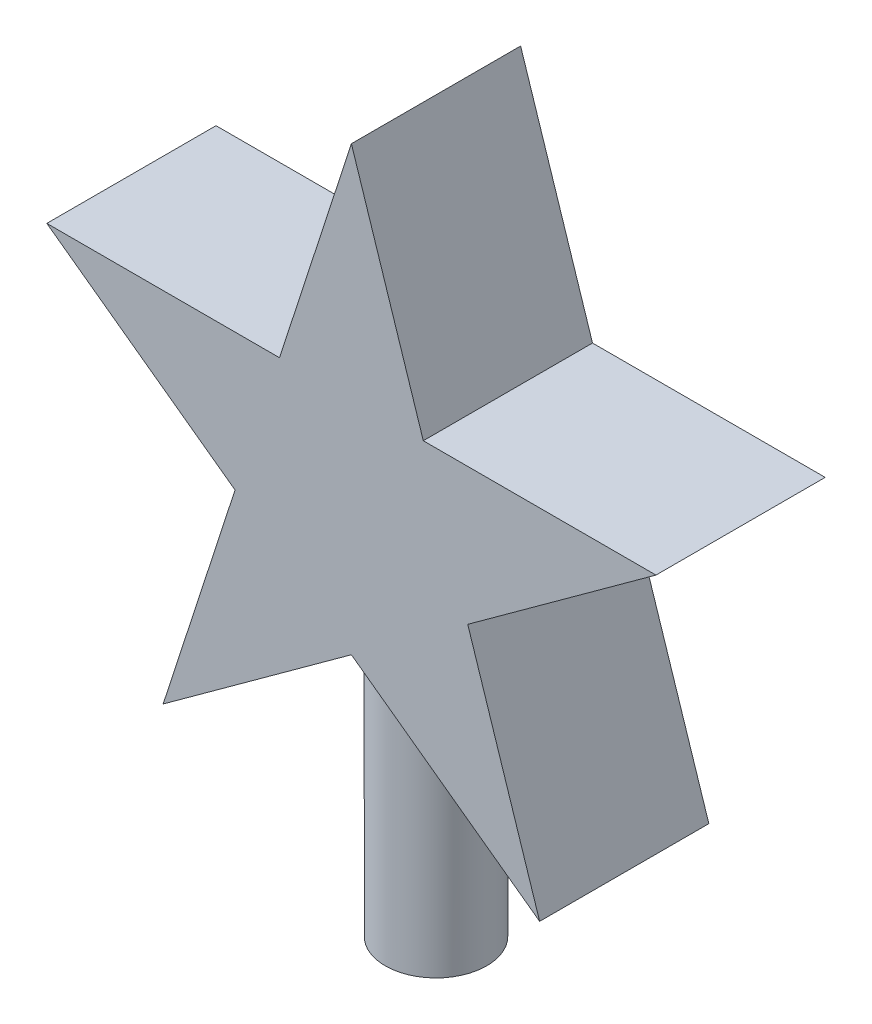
ISO-10303-21;
HEADER;
FILE_DESCRIPTION(('STEP AP214'),'2;1');
FILE_NAME('part.step','',(''),(''),'','','');
FILE_SCHEMA(('AUTOMOTIVE_DESIGN { 1 0 10303 214 1 1 1 1 }'));
ENDSEC;
DATA;
#1=APPLICATION_CONTEXT('core data for automotive mechanical design processes');
#2=APPLICATION_PROTOCOL_DEFINITION('international standard','automotive_design',2000,#1);
#3=PRODUCT_CONTEXT('',#1,'mechanical');
#4=PRODUCT('Part','Part','',(#3));
#5=PRODUCT_RELATED_PRODUCT_CATEGORY('part','',(#4));
#6=PRODUCT_DEFINITION_FORMATION('','',#4);
#7=PRODUCT_DEFINITION_CONTEXT('part definition',#1,'design');
#8=PRODUCT_DEFINITION('design','',#6,#7);
#9=PRODUCT_DEFINITION_SHAPE('','',#8);
#10=(LENGTH_UNIT() NAMED_UNIT(*) SI_UNIT(.MILLI.,.METRE.));
#11=(NAMED_UNIT(*) PLANE_ANGLE_UNIT() SI_UNIT($,.RADIAN.));
#12=(NAMED_UNIT(*) SI_UNIT($,.STERADIAN.) SOLID_ANGLE_UNIT());
#13=UNCERTAINTY_MEASURE_WITH_UNIT(LENGTH_MEASURE(1.E-05),#10,'distance_accuracy_value','');
#14=(GEOMETRIC_REPRESENTATION_CONTEXT(3) GLOBAL_UNCERTAINTY_ASSIGNED_CONTEXT((#13)) GLOBAL_UNIT_ASSIGNED_CONTEXT((#10,
#11,#12)) REPRESENTATION_CONTEXT('',''));
#15=CARTESIAN_POINT('',(0.,0.,0.));
#16=DIRECTION('',(0.,0.,1.));
#17=DIRECTION('',(1.,0.,0.));
#18=AXIS2_PLACEMENT_3D('',#15,#16,#17);
#19=CARTESIAN_POINT('',(0.,9.46316001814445,5.));
#20=DIRECTION('',(0.951056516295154,-0.309016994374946,0.));
#21=DIRECTION('',(0.309016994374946,0.951056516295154,0.));
#22=AXIS2_PLACEMENT_3D('',#19,#20,#21);
#23=PLANE('',#22);
#24=DIRECTION('',(-0.309016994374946,-0.951056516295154,0.));
#25=VECTOR('',#24,1.);
#26=CARTESIAN_POINT('',(0.,9.46316001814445,0.));
#27=LINE('',#26,#25);
#28=CARTESIAN_POINT('',(0.,9.46316001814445,0.));
#29=VERTEX_POINT('',#28);
#30=CARTESIAN_POINT('',(-2.12461179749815,2.92427726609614,0.));
#31=VERTEX_POINT('',#30);
#32=EDGE_CURVE('E161',#29,#31,#27,.T.);
#33=ORIENTED_EDGE('',*,*,#32,.T.);
#34=DIRECTION('',(0.,0.,-1.));
#35=VECTOR('',#34,1.);
#36=CARTESIAN_POINT('',(-2.12461179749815,2.92427726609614,5.));
#37=LINE('',#36,#35);
#38=CARTESIAN_POINT('',(-2.12461179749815,2.92427726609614,5.));
#39=VERTEX_POINT('',#38);
#40=EDGE_CURVE('E47',#39,#31,#37,.T.);
#41=ORIENTED_EDGE('',*,*,#40,.F.);
#42=DIRECTION('',(-0.309016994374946,-0.951056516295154,0.));
#43=VECTOR('',#42,1.);
#44=CARTESIAN_POINT('',(0.,9.46316001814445,5.));
#45=LINE('',#44,#43);
#46=CARTESIAN_POINT('',(0.,9.46316001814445,5.));
#47=VERTEX_POINT('',#46);
#48=EDGE_CURVE('E191',#47,#39,#45,.T.);
#49=ORIENTED_EDGE('',*,*,#48,.F.);
#50=DIRECTION('',(0.,0.,-1.));
#51=VECTOR('',#50,1.);
#52=CARTESIAN_POINT('',(0.,9.46316001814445,5.));
#53=LINE('',#52,#51);
#54=EDGE_CURVE('E157',#47,#29,#53,.T.);
#55=ORIENTED_EDGE('',*,*,#54,.T.);
#56=EDGE_LOOP('',(#33,#41,#49,#55));
#57=FACE_BOUND('',#56,.T.);
#58=ADVANCED_FACE('F39',(#57),#23,.F.);
#59=CARTESIAN_POINT('',(-8.99999999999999,2.92427726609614,5.));
#60=DIRECTION('',(0.,-1.,0.));
#61=DIRECTION('',(1.,0.,0.));
#62=AXIS2_PLACEMENT_3D('',#59,#60,#61);
#63=PLANE('',#62);
#64=DIRECTION('',(-1.,0.,0.));
#65=VECTOR('',#64,1.);
#66=CARTESIAN_POINT('',(-8.99999999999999,2.92427726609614,0.));
#67=LINE('',#66,#65);
#68=CARTESIAN_POINT('',(-8.99999999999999,2.92427726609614,0.));
#69=VERTEX_POINT('',#68);
#70=EDGE_CURVE('E165',#31,#69,#67,.T.);
#71=ORIENTED_EDGE('',*,*,#70,.T.);
#72=DIRECTION('',(0.,0.,-1.));
#73=VECTOR('',#72,1.);
#74=CARTESIAN_POINT('',(-8.99999999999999,2.92427726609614,5.));
#75=LINE('',#74,#73);
#76=CARTESIAN_POINT('',(-8.99999999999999,2.92427726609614,5.));
#77=VERTEX_POINT('',#76);
#78=EDGE_CURVE('E215',#77,#69,#75,.T.);
#79=ORIENTED_EDGE('',*,*,#78,.F.);
#80=DIRECTION('',(-1.,0.,0.));
#81=VECTOR('',#80,1.);
#82=CARTESIAN_POINT('',(-8.99999999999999,2.92427726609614,5.));
#83=LINE('',#82,#81);
#84=EDGE_CURVE('E109',#39,#77,#83,.T.);
#85=ORIENTED_EDGE('',*,*,#84,.F.);
#86=ORIENTED_EDGE('',*,*,#40,.T.);
#87=EDGE_LOOP('',(#71,#79,#85,#86));
#88=FACE_BOUND('',#87,.T.);
#89=ADVANCED_FACE('F220',(#88),#63,.F.);
#90=CARTESIAN_POINT('',(-8.99999999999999,2.92427726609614,5.));
#91=DIRECTION('',(0.587785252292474,0.809016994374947,0.));
#92=DIRECTION('',(-0.809016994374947,0.587785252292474,0.));
#93=AXIS2_PLACEMENT_3D('',#90,#91,#92);
#94=PLANE('',#93);
#95=DIRECTION('',(0.809016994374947,-0.587785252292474,0.));
#96=VECTOR('',#95,1.);
#97=CARTESIAN_POINT('',(-8.99999999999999,2.92427726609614,0.));
#98=LINE('',#97,#96);
#99=CARTESIAN_POINT('',(-3.43769410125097,-1.11697452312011,0.));
#100=VERTEX_POINT('',#99);
#101=EDGE_CURVE('E168',#69,#100,#98,.T.);
#102=ORIENTED_EDGE('',*,*,#101,.T.);
#103=DIRECTION('',(0.,0.,-1.));
#104=VECTOR('',#103,1.);
#105=CARTESIAN_POINT('',(-3.43769410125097,-1.11697452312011,5.));
#106=LINE('',#105,#104);
#107=CARTESIAN_POINT('',(-3.43769410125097,-1.11697452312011,5.));
#108=VERTEX_POINT('',#107);
#109=EDGE_CURVE('E211',#108,#100,#106,.T.);
#110=ORIENTED_EDGE('',*,*,#109,.F.);
#111=DIRECTION('',(0.809016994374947,-0.587785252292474,0.));
#112=VECTOR('',#111,1.);
#113=CARTESIAN_POINT('',(-8.99999999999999,2.92427726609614,5.));
#114=LINE('',#113,#112);
#115=EDGE_CURVE('E241',#77,#108,#114,.T.);
#116=ORIENTED_EDGE('',*,*,#115,.F.);
#117=ORIENTED_EDGE('',*,*,#78,.T.);
#118=EDGE_LOOP('',(#102,#110,#116,#117));
#119=FACE_BOUND('',#118,.T.);
#120=ADVANCED_FACE('F231',(#119),#94,.F.);
#121=CARTESIAN_POINT('',(-3.43769410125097,-1.11697452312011,5.));
#122=DIRECTION('',(0.951056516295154,-0.309016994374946,0.));
#123=DIRECTION('',(0.309016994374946,0.951056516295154,0.));
#124=AXIS2_PLACEMENT_3D('',#121,#122,#123);
#125=PLANE('',#124);
#126=DIRECTION('',(-0.309016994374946,-0.951056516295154,0.));
#127=VECTOR('',#126,1.);
#128=CARTESIAN_POINT('',(-3.43769410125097,-1.11697452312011,0.));
#129=LINE('',#128,#127);
#130=CARTESIAN_POINT('',(-5.56230589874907,-7.65585727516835,0.));
#131=VERTEX_POINT('',#130);
#132=EDGE_CURVE('E171',#100,#131,#129,.T.);
#133=ORIENTED_EDGE('',*,*,#132,.T.);
#134=DIRECTION('',(0.,0.,-1.));
#135=VECTOR('',#134,1.);
#136=CARTESIAN_POINT('',(-5.56230589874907,-7.65585727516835,5.));
#137=LINE('',#136,#135);
#138=CARTESIAN_POINT('',(-5.56230589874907,-7.65585727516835,5.));
#139=VERTEX_POINT('',#138);
#140=EDGE_CURVE('E207',#139,#131,#137,.T.);
#141=ORIENTED_EDGE('',*,*,#140,.F.);
#142=DIRECTION('',(-0.309016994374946,-0.951056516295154,0.));
#143=VECTOR('',#142,1.);
#144=CARTESIAN_POINT('',(-3.43769410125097,-1.11697452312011,5.));
#145=LINE('',#144,#143);
#146=EDGE_CURVE('E237',#108,#139,#145,.T.);
#147=ORIENTED_EDGE('',*,*,#146,.F.);
#148=ORIENTED_EDGE('',*,*,#109,.T.);
#149=EDGE_LOOP('',(#133,#141,#147,#148));
#150=FACE_BOUND('',#149,.T.);
#151=ADVANCED_FACE('F235',(#150),#125,.F.);
#152=CARTESIAN_POINT('',(0.,-3.6146054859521,5.));
#153=DIRECTION('',(-0.587785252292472,0.809016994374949,0.));
#154=DIRECTION('',(-0.809016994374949,-0.587785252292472,0.));
#155=AXIS2_PLACEMENT_3D('',#152,#153,#154);
#156=PLANE('',#155);
#157=DIRECTION('',(0.,0.,-1.));
#158=VECTOR('',#157,1.);
#159=CARTESIAN_POINT('',(0.,-3.6146054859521,5.));
#160=LINE('',#159,#158);
#161=CARTESIAN_POINT('',(0.,-3.6146054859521,1.));
#162=VERTEX_POINT('',#161);
#163=CARTESIAN_POINT('',(0.,-3.6146054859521,0.));
#164=VERTEX_POINT('',#163);
#165=EDGE_CURVE('E202',#162,#164,#160,.T.);
#166=ORIENTED_EDGE('',*,*,#165,.F.);
#167=CARTESIAN_POINT('',(0.,-3.61460548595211,2.5));
#168=DIRECTION('',(-0.587785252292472,0.809016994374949,0.));
#169=DIRECTION('',(0.809016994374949,0.587785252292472,0.));
#170=AXIS2_PLACEMENT_3D('',#167,#168,#169);
#171=ELLIPSE('',#170,1.85410196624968,1.5);
#172=CARTESIAN_POINT('',(0.,-3.6146054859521,4.));
#173=VERTEX_POINT('',#172);
#174=EDGE_CURVE('E53',#162,#173,#171,.T.);
#175=ORIENTED_EDGE('',*,*,#174,.T.);
#176=CARTESIAN_POINT('',(0.,-3.6146054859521,5.));
#177=VERTEX_POINT('',#176);
#178=EDGE_CURVE('E203',#177,#173,#160,.T.);
#179=ORIENTED_EDGE('',*,*,#178,.F.);
#180=DIRECTION('',(0.809016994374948,0.587785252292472,0.));
#181=VECTOR('',#180,1.);
#182=CARTESIAN_POINT('',(0.,-3.6146054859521,5.));
#183=LINE('',#182,#181);
#184=EDGE_CURVE('E240',#139,#177,#183,.T.);
#185=ORIENTED_EDGE('',*,*,#184,.F.);
#186=ORIENTED_EDGE('',*,*,#140,.T.);
#187=DIRECTION('',(0.809016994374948,0.587785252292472,0.));
#188=VECTOR('',#187,1.);
#189=CARTESIAN_POINT('',(0.,-3.6146054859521,0.));
#190=LINE('',#189,#188);
#191=EDGE_CURVE('E174',#131,#164,#190,.T.);
#192=ORIENTED_EDGE('',*,*,#191,.T.);
#193=EDGE_LOOP('',(#166,#175,#179,#185,#186,#192));
#194=FACE_BOUND('',#193,.T.);
#195=ADVANCED_FACE('F293',(#194),#156,.F.);
#196=CARTESIAN_POINT('',(0.,-3.6146054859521,5.));
#197=DIRECTION('',(0.587785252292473,0.809016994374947,0.));
#198=DIRECTION('',(-0.809016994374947,0.587785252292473,0.));
#199=AXIS2_PLACEMENT_3D('',#196,#197,#198);
#200=PLANE('',#199);
#201=ORIENTED_EDGE('',*,*,#178,.T.);
#202=CARTESIAN_POINT('',(0.,-3.61460548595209,2.5));
#203=DIRECTION('',(0.587785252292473,0.809016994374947,0.));
#204=DIRECTION('',(-0.809016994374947,0.587785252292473,0.));
#205=AXIS2_PLACEMENT_3D('',#202,#203,#204);
#206=ELLIPSE('',#205,1.85410196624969,1.5);
#207=EDGE_CURVE('E11',#173,#162,#206,.T.);
#208=ORIENTED_EDGE('',*,*,#207,.T.);
#209=ORIENTED_EDGE('',*,*,#165,.T.);
#210=DIRECTION('',(0.809016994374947,-0.587785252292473,0.));
#211=VECTOR('',#210,1.);
#212=CARTESIAN_POINT('',(0.,-3.6146054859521,0.));
#213=LINE('',#212,#211);
#214=CARTESIAN_POINT('',(5.56230589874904,-7.65585727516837,0.));
#215=VERTEX_POINT('',#214);
#216=EDGE_CURVE('E178',#164,#215,#213,.T.);
#217=ORIENTED_EDGE('',*,*,#216,.T.);
#218=DIRECTION('',(0.,0.,-1.));
#219=VECTOR('',#218,1.);
#220=CARTESIAN_POINT('',(5.56230589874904,-7.65585727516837,5.));
#221=LINE('',#220,#219);
#222=CARTESIAN_POINT('',(5.56230589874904,-7.65585727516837,5.));
#223=VERTEX_POINT('',#222);
#224=EDGE_CURVE('E198',#223,#215,#221,.T.);
#225=ORIENTED_EDGE('',*,*,#224,.F.);
#226=DIRECTION('',(0.809016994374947,-0.587785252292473,0.));
#227=VECTOR('',#226,1.);
#228=CARTESIAN_POINT('',(0.,-3.6146054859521,5.));
#229=LINE('',#228,#227);
#230=EDGE_CURVE('E245',#177,#223,#229,.T.);
#231=ORIENTED_EDGE('',*,*,#230,.F.);
#232=EDGE_LOOP('',(#201,#208,#209,#217,#225,#231));
#233=FACE_BOUND('',#232,.T.);
#234=ADVANCED_FACE('F256',(#233),#200,.F.);
#235=CARTESIAN_POINT('',(3.43769410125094,-1.11697452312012,5.));
#236=DIRECTION('',(-0.951056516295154,-0.309016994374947,0.));
#237=DIRECTION('',(0.309016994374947,-0.951056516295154,0.));
#238=AXIS2_PLACEMENT_3D('',#235,#236,#237);
#239=PLANE('',#238);
#240=DIRECTION('',(-0.309016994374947,0.951056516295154,0.));
#241=VECTOR('',#240,1.);
#242=CARTESIAN_POINT('',(3.43769410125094,-1.11697452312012,0.));
#243=LINE('',#242,#241);
#244=CARTESIAN_POINT('',(3.43769410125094,-1.11697452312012,0.));
#245=VERTEX_POINT('',#244);
#246=EDGE_CURVE('E181',#215,#245,#243,.T.);
#247=ORIENTED_EDGE('',*,*,#246,.T.);
#248=DIRECTION('',(0.,0.,-1.));
#249=VECTOR('',#248,1.);
#250=CARTESIAN_POINT('',(3.43769410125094,-1.11697452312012,5.));
#251=LINE('',#250,#249);
#252=CARTESIAN_POINT('',(3.43769410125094,-1.11697452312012,5.));
#253=VERTEX_POINT('',#252);
#254=EDGE_CURVE('E150',#253,#245,#251,.T.);
#255=ORIENTED_EDGE('',*,*,#254,.F.);
#256=DIRECTION('',(-0.309016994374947,0.951056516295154,0.));
#257=VECTOR('',#256,1.);
#258=CARTESIAN_POINT('',(3.43769410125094,-1.11697452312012,5.));
#259=LINE('',#258,#257);
#260=EDGE_CURVE('E136',#223,#253,#259,.T.);
#261=ORIENTED_EDGE('',*,*,#260,.F.);
#262=ORIENTED_EDGE('',*,*,#224,.T.);
#263=EDGE_LOOP('',(#247,#255,#261,#262));
#264=FACE_BOUND('',#263,.T.);
#265=ADVANCED_FACE('F260',(#264),#239,.F.);
#266=CARTESIAN_POINT('',(9.00000000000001,2.92427726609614,5.));
#267=DIRECTION('',(-0.587785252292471,0.809016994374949,0.));
#268=DIRECTION('',(-0.809016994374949,-0.587785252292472,0.));
#269=AXIS2_PLACEMENT_3D('',#266,#267,#268);
#270=PLANE('',#269);
#271=DIRECTION('',(0.809016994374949,0.587785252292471,0.));
#272=VECTOR('',#271,1.);
#273=CARTESIAN_POINT('',(9.00000000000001,2.92427726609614,0.));
#274=LINE('',#273,#272);
#275=CARTESIAN_POINT('',(9.00000000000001,2.92427726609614,0.));
#276=VERTEX_POINT('',#275);
#277=EDGE_CURVE('E146',#245,#276,#274,.T.);
#278=ORIENTED_EDGE('',*,*,#277,.T.);
#279=DIRECTION('',(0.,0.,-1.));
#280=VECTOR('',#279,1.);
#281=CARTESIAN_POINT('',(9.00000000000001,2.92427726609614,5.));
#282=LINE('',#281,#280);
#283=CARTESIAN_POINT('',(9.00000000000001,2.92427726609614,5.));
#284=VERTEX_POINT('',#283);
#285=EDGE_CURVE('E143',#284,#276,#282,.T.);
#286=ORIENTED_EDGE('',*,*,#285,.F.);
#287=DIRECTION('',(0.809016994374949,0.587785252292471,0.));
#288=VECTOR('',#287,1.);
#289=CARTESIAN_POINT('',(9.00000000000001,2.92427726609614,5.));
#290=LINE('',#289,#288);
#291=EDGE_CURVE('E129',#253,#284,#290,.T.);
#292=ORIENTED_EDGE('',*,*,#291,.F.);
#293=ORIENTED_EDGE('',*,*,#254,.T.);
#294=EDGE_LOOP('',(#278,#286,#292,#293));
#295=FACE_BOUND('',#294,.T.);
#296=ADVANCED_FACE('F144',(#295),#270,.F.);
#297=CARTESIAN_POINT('',(2.1246117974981,2.92427726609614,5.));
#298=DIRECTION('',(0.,-1.,0.));
#299=DIRECTION('',(1.,0.,0.));
#300=AXIS2_PLACEMENT_3D('',#297,#298,#299);
#301=PLANE('',#300);
#302=DIRECTION('',(-1.,0.,0.));
#303=VECTOR('',#302,1.);
#304=CARTESIAN_POINT('',(2.1246117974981,2.92427726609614,0.));
#305=LINE('',#304,#303);
#306=CARTESIAN_POINT('',(2.1246117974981,2.92427726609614,0.));
#307=VERTEX_POINT('',#306);
#308=EDGE_CURVE('E186',#276,#307,#305,.T.);
#309=ORIENTED_EDGE('',*,*,#308,.T.);
#310=DIRECTION('',(0.,0.,-1.));
#311=VECTOR('',#310,1.);
#312=CARTESIAN_POINT('',(2.1246117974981,2.92427726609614,5.));
#313=LINE('',#312,#311);
#314=CARTESIAN_POINT('',(2.1246117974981,2.92427726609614,5.));
#315=VERTEX_POINT('',#314);
#316=EDGE_CURVE('E151',#315,#307,#313,.T.);
#317=ORIENTED_EDGE('',*,*,#316,.F.);
#318=DIRECTION('',(-1.,0.,0.));
#319=VECTOR('',#318,1.);
#320=CARTESIAN_POINT('',(2.1246117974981,2.92427726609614,5.));
#321=LINE('',#320,#319);
#322=EDGE_CURVE('E133',#284,#315,#321,.T.);
#323=ORIENTED_EDGE('',*,*,#322,.F.);
#324=ORIENTED_EDGE('',*,*,#285,.T.);
#325=EDGE_LOOP('',(#309,#317,#323,#324));
#326=FACE_BOUND('',#325,.T.);
#327=ADVANCED_FACE('F153',(#326),#301,.F.);
#328=CARTESIAN_POINT('',(0.,9.46316001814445,5.));
#329=DIRECTION('',(-0.951056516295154,-0.309016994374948,0.));
#330=DIRECTION('',(0.309016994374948,-0.951056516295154,0.));
#331=AXIS2_PLACEMENT_3D('',#328,#329,#330);
#332=PLANE('',#331);
#333=DIRECTION('',(-0.309016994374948,0.951056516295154,0.));
#334=VECTOR('',#333,1.);
#335=CARTESIAN_POINT('',(0.,9.46316001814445,0.));
#336=LINE('',#335,#334);
#337=EDGE_CURVE('E100',#307,#29,#336,.T.);
#338=ORIENTED_EDGE('',*,*,#337,.T.);
#339=ORIENTED_EDGE('',*,*,#54,.F.);
#340=DIRECTION('',(-0.309016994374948,0.951056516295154,0.));
#341=VECTOR('',#340,1.);
#342=CARTESIAN_POINT('',(0.,9.46316001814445,5.));
#343=LINE('',#342,#341);
#344=EDGE_CURVE('E61',#315,#47,#343,.T.);
#345=ORIENTED_EDGE('',*,*,#344,.F.);
#346=ORIENTED_EDGE('',*,*,#316,.T.);
#347=EDGE_LOOP('',(#338,#339,#345,#346));
#348=FACE_BOUND('',#347,.T.);
#349=ADVANCED_FACE('F261',(#348),#332,.F.);
#350=CARTESIAN_POINT('',(0.,0.,5.));
#351=DIRECTION('',(0.,0.,1.));
#352=DIRECTION('',(1.,0.,0.));
#353=AXIS2_PLACEMENT_3D('',#350,#351,#352);
#354=PLANE('',#353);
#355=ORIENTED_EDGE('',*,*,#48,.T.);
#356=ORIENTED_EDGE('',*,*,#84,.T.);
#357=ORIENTED_EDGE('',*,*,#115,.T.);
#358=ORIENTED_EDGE('',*,*,#146,.T.);
#359=ORIENTED_EDGE('',*,*,#184,.T.);
#360=ORIENTED_EDGE('',*,*,#230,.T.);
#361=ORIENTED_EDGE('',*,*,#260,.T.);
#362=ORIENTED_EDGE('',*,*,#291,.T.);
#363=ORIENTED_EDGE('',*,*,#322,.T.);
#364=ORIENTED_EDGE('',*,*,#344,.T.);
#365=EDGE_LOOP('',(#355,#356,#357,#358,#359,#360,#361,#362,#363,#364));
#366=FACE_BOUND('',#365,.T.);
#367=ADVANCED_FACE('F131',(#366),#354,.T.);
#368=CARTESIAN_POINT('',(0.,0.,0.));
#369=DIRECTION('',(0.,0.,1.));
#370=DIRECTION('',(1.,0.,0.));
#371=AXIS2_PLACEMENT_3D('',#368,#369,#370);
#372=PLANE('',#371);
#373=ORIENTED_EDGE('',*,*,#32,.F.);
#374=ORIENTED_EDGE('',*,*,#337,.F.);
#375=ORIENTED_EDGE('',*,*,#308,.F.);
#376=ORIENTED_EDGE('',*,*,#277,.F.);
#377=ORIENTED_EDGE('',*,*,#246,.F.);
#378=ORIENTED_EDGE('',*,*,#216,.F.);
#379=ORIENTED_EDGE('',*,*,#191,.F.);
#380=ORIENTED_EDGE('',*,*,#132,.F.);
#381=ORIENTED_EDGE('',*,*,#101,.F.);
#382=ORIENTED_EDGE('',*,*,#70,.F.);
#383=EDGE_LOOP('',(#373,#374,#375,#376,#377,#378,#379,#380,#381,#382));
#384=FACE_BOUND('',#383,.T.);
#385=ADVANCED_FACE('F225',(#384),#372,.F.);
#386=CARTESIAN_POINT('',(0.,-12.0757227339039,2.5));
#387=DIRECTION('',(0.,1.,0.));
#388=DIRECTION('',(-1.,0.,0.));
#389=AXIS2_PLACEMENT_3D('',#386,#387,#388);
#390=CYLINDRICAL_SURFACE('',#389,1.5);
#391=CARTESIAN_POINT('',(0.,-12.0757227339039,2.5));
#392=DIRECTION('',(0.,1.,0.));
#393=DIRECTION('',(-1.,0.,0.));
#394=AXIS2_PLACEMENT_3D('',#391,#392,#393);
#395=CIRCLE('',#394,1.5);
#396=CARTESIAN_POINT('',(-1.50000000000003,-12.0757227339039,2.5));
#397=VERTEX_POINT('',#396);
#398=EDGE_CURVE('E268',#397,#397,#395,.T.);
#399=ORIENTED_EDGE('',*,*,#398,.T.);
#400=EDGE_LOOP('',(#399));
#401=FACE_BOUND('',#400,.T.);
#402=ORIENTED_EDGE('',*,*,#174,.F.);
#403=ORIENTED_EDGE('',*,*,#207,.F.);
#404=EDGE_LOOP('',(#402,#403));
#405=FACE_BOUND('',#404,.T.);
#406=ADVANCED_FACE('F273',(#401,#405),#390,.T.);
#407=CARTESIAN_POINT('',(0.,-12.0757227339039,2.5));
#408=DIRECTION('',(0.,1.,0.));
#409=DIRECTION('',(-1.,0.,0.));
#410=AXIS2_PLACEMENT_3D('',#407,#408,#409);
#411=PLANE('',#410);
#412=ORIENTED_EDGE('',*,*,#398,.F.);
#413=EDGE_LOOP('',(#412));
#414=FACE_BOUND('',#413,.T.);
#415=ADVANCED_FACE('F275',(#414),#411,.F.);
#416=CLOSED_SHELL('',(#58,#89,#120,#151,#195,#234,#265,#296,#327,#349,#367,#385,#406,#415));
#417=MANIFOLD_SOLID_BREP('B2',#416);
#418=ADVANCED_BREP_SHAPE_REPRESENTATION('',(#18,#417),#14);
#419=SHAPE_DEFINITION_REPRESENTATION(#9,#418);
ENDSEC;
END-ISO-10303-21;
